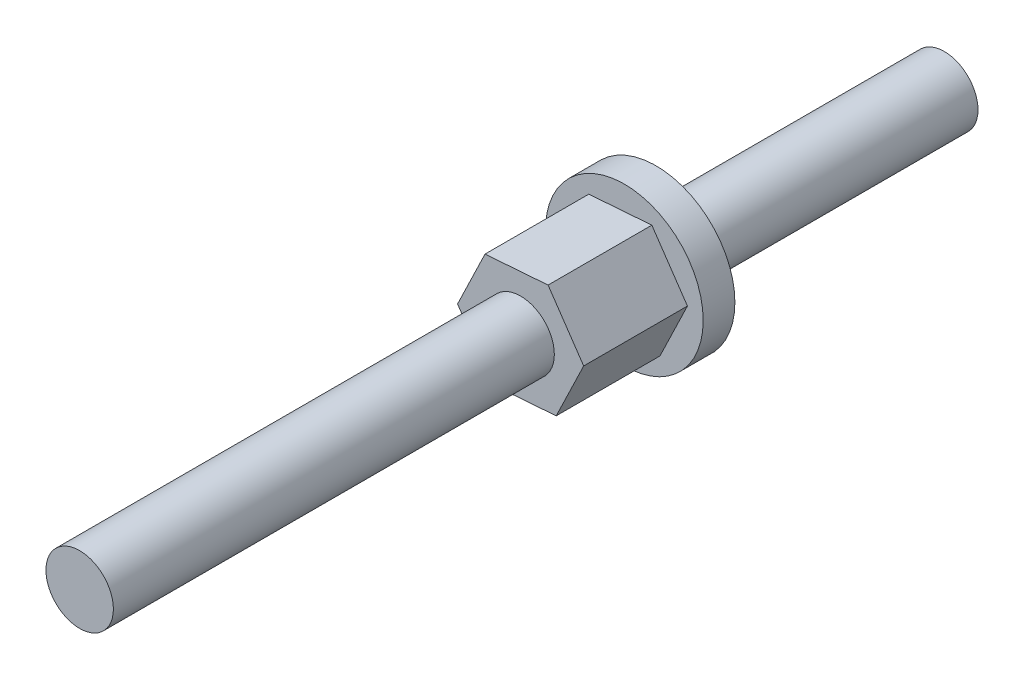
ISO-10303-21;
HEADER;
FILE_DESCRIPTION(('STEP AP214'),'2;1');
FILE_NAME('part.step','',(''),(''),'','','');
FILE_SCHEMA(('AUTOMOTIVE_DESIGN { 1 0 10303 214 1 1 1 1 }'));
ENDSEC;
DATA;
#1=APPLICATION_CONTEXT('core data for automotive mechanical design processes');
#2=APPLICATION_PROTOCOL_DEFINITION('international standard','automotive_design',2000,#1);
#3=PRODUCT_CONTEXT('',#1,'mechanical');
#4=PRODUCT('Part','Part','',(#3));
#5=PRODUCT_RELATED_PRODUCT_CATEGORY('part','',(#4));
#6=PRODUCT_DEFINITION_FORMATION('','',#4);
#7=PRODUCT_DEFINITION_CONTEXT('part definition',#1,'design');
#8=PRODUCT_DEFINITION('design','',#6,#7);
#9=PRODUCT_DEFINITION_SHAPE('','',#8);
#10=(LENGTH_UNIT() NAMED_UNIT(*) SI_UNIT(.MILLI.,.METRE.));
#11=(NAMED_UNIT(*) PLANE_ANGLE_UNIT() SI_UNIT($,.RADIAN.));
#12=(NAMED_UNIT(*) SI_UNIT($,.STERADIAN.) SOLID_ANGLE_UNIT());
#13=UNCERTAINTY_MEASURE_WITH_UNIT(LENGTH_MEASURE(1.E-05),#10,'distance_accuracy_value','');
#14=(GEOMETRIC_REPRESENTATION_CONTEXT(3) GLOBAL_UNCERTAINTY_ASSIGNED_CONTEXT((#13)) GLOBAL_UNIT_ASSIGNED_CONTEXT((#10,
#11,#12)) REPRESENTATION_CONTEXT('',''));
#15=CARTESIAN_POINT('',(0.,0.,0.));
#16=DIRECTION('',(0.,0.,1.));
#17=DIRECTION('',(1.,0.,0.));
#18=AXIS2_PLACEMENT_3D('',#15,#16,#17);
#19=CARTESIAN_POINT('',(70.1748640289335,0.,2.794));
#20=DIRECTION('',(0.,0.,1.));
#21=DIRECTION('',(1.,0.,0.));
#22=AXIS2_PLACEMENT_3D('',#19,#20,#21);
#23=PLANE('',#22);
#24=CARTESIAN_POINT('',(70.1748640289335,0.,2.794));
#25=DIRECTION('',(0.,0.,1.));
#26=DIRECTION('',(1.,0.,0.));
#27=AXIS2_PLACEMENT_3D('',#24,#25,#26);
#28=CIRCLE('',#27,6.94690000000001);
#29=CARTESIAN_POINT('',(77.1217640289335,0.,2.794));
#30=VERTEX_POINT('',#29);
#31=EDGE_CURVE('E127',#30,#30,#28,.T.);
#32=ORIENTED_EDGE('',*,*,#31,.T.);
#33=EDGE_LOOP('',(#32));
#34=FACE_BOUND('',#33,.T.);
#35=DIRECTION('',(-0.434295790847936,-0.9007703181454,0.));
#36=VECTOR('',#35,1.);
#37=CARTESIAN_POINT('',(74.5219815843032,-2.09591148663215,2.794));
#38=LINE('',#37,#36);
#39=CARTESIAN_POINT('',(75.7320566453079,0.413898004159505,2.794));
#40=VERTEX_POINT('',#39);
#41=CARTESIAN_POINT('',(73.3119065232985,-4.6057209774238,2.794));
#42=VERTEX_POINT('',#41);
#43=EDGE_CURVE('E123',#40,#42,#38,.T.);
#44=ORIENTED_EDGE('',*,*,#43,.T.);
#45=DIRECTION('',(-0.997237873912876,-0.0742739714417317,0.));
#46=VECTOR('',#45,1.);
#47=CARTESIAN_POINT('',(70.5333102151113,-4.81266997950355,2.794));
#48=LINE('',#47,#46);
#49=CARTESIAN_POINT('',(67.7547139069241,-5.0196189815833,2.794));
#50=VERTEX_POINT('',#49);
#51=EDGE_CURVE('E56',#42,#50,#48,.T.);
#52=ORIENTED_EDGE('',*,*,#51,.T.);
#53=DIRECTION('',(-0.562942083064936,0.826496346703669,0.));
#54=VECTOR('',#53,1.);
#55=CARTESIAN_POINT('',(66.1861926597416,-2.71675849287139,2.794));
#56=LINE('',#55,#54);
#57=CARTESIAN_POINT('',(64.6176714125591,-0.413898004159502,2.794));
#58=VERTEX_POINT('',#57);
#59=EDGE_CURVE('E106',#50,#58,#56,.T.);
#60=ORIENTED_EDGE('',*,*,#59,.T.);
#61=DIRECTION('',(0.434295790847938,0.9007703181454,0.));
#62=VECTOR('',#61,1.);
#63=CARTESIAN_POINT('',(65.8277464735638,2.09591148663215,2.794));
#64=LINE('',#63,#62);
#65=CARTESIAN_POINT('',(67.0378215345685,4.60572097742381,2.794));
#66=VERTEX_POINT('',#65);
#67=EDGE_CURVE('E109',#58,#66,#64,.T.);
#68=ORIENTED_EDGE('',*,*,#67,.T.);
#69=DIRECTION('',(0.997237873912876,0.0742739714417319,0.));
#70=VECTOR('',#69,1.);
#71=CARTESIAN_POINT('',(69.8164178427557,4.81266997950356,2.794));
#72=LINE('',#71,#70);
#73=CARTESIAN_POINT('',(72.595014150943,5.01961898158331,2.794));
#74=VERTEX_POINT('',#73);
#75=EDGE_CURVE('E117',#66,#74,#72,.T.);
#76=ORIENTED_EDGE('',*,*,#75,.T.);
#77=DIRECTION('',(0.562942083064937,-0.826496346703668,0.));
#78=VECTOR('',#77,1.);
#79=CARTESIAN_POINT('',(74.1635353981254,2.7167584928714,2.794));
#80=LINE('',#79,#78);
#81=EDGE_CURVE('E120',#74,#40,#80,.T.);
#82=ORIENTED_EDGE('',*,*,#81,.T.);
#83=EDGE_LOOP('',(#44,#52,#60,#68,#76,#82));
#84=FACE_BOUND('',#83,.T.);
#85=ADVANCED_FACE('F33',(#34,#84),#23,.T.);
#86=CARTESIAN_POINT('',(70.1748640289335,0.,2.794));
#87=DIRECTION('',(0.,0.,-1.));
#88=DIRECTION('',(-1.,0.,0.));
#89=AXIS2_PLACEMENT_3D('',#86,#87,#88);
#90=CYLINDRICAL_SURFACE('',#89,6.94690000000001);
#91=ORIENTED_EDGE('',*,*,#31,.F.);
#92=EDGE_LOOP('',(#91));
#93=FACE_BOUND('',#92,.T.);
#94=CARTESIAN_POINT('',(70.1748640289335,0.,0.));
#95=DIRECTION('',(0.,0.,1.));
#96=DIRECTION('',(1.,0.,0.));
#97=AXIS2_PLACEMENT_3D('',#94,#95,#96);
#98=CIRCLE('',#97,6.94690000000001);
#99=CARTESIAN_POINT('',(77.1217640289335,0.,0.));
#100=VERTEX_POINT('',#99);
#101=EDGE_CURVE('E126',#100,#100,#98,.T.);
#102=ORIENTED_EDGE('',*,*,#101,.T.);
#103=EDGE_LOOP('',(#102));
#104=FACE_BOUND('',#103,.T.);
#105=ADVANCED_FACE('F146',(#93,#104),#90,.T.);
#106=CARTESIAN_POINT('',(70.1748640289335,0.,0.));
#107=DIRECTION('',(0.,0.,1.));
#108=DIRECTION('',(1.,0.,0.));
#109=AXIS2_PLACEMENT_3D('',#106,#107,#108);
#110=PLANE('',#109);
#111=CARTESIAN_POINT('',(70.1748640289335,0.,0.));
#112=DIRECTION('',(0.,0.,1.));
#113=DIRECTION('',(1.,0.,0.));
#114=AXIS2_PLACEMENT_3D('',#111,#112,#113);
#115=CIRCLE('',#114,2.9718);
#116=CARTESIAN_POINT('',(73.1466640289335,0.,0.));
#117=VERTEX_POINT('',#116);
#118=EDGE_CURVE('E130',#117,#117,#115,.F.);
#119=ORIENTED_EDGE('',*,*,#118,.F.);
#120=EDGE_LOOP('',(#119));
#121=FACE_BOUND('',#120,.T.);
#122=ORIENTED_EDGE('',*,*,#101,.F.);
#123=EDGE_LOOP('',(#122));
#124=FACE_BOUND('',#123,.T.);
#125=ADVANCED_FACE('F142',(#121,#124),#110,.F.);
#126=CARTESIAN_POINT('',(70.1748640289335,0.,-25.4));
#127=DIRECTION('',(0.,0.,1.));
#128=DIRECTION('',(1.,0.,0.));
#129=AXIS2_PLACEMENT_3D('',#126,#127,#128);
#130=PLANE('',#129);
#131=CARTESIAN_POINT('',(70.1748640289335,0.,-25.4));
#132=DIRECTION('',(0.,0.,1.));
#133=DIRECTION('',(1.,0.,0.));
#134=AXIS2_PLACEMENT_3D('',#131,#132,#133);
#135=CIRCLE('',#134,2.9718);
#136=CARTESIAN_POINT('',(73.1466640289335,0.,-25.4));
#137=VERTEX_POINT('',#136);
#138=EDGE_CURVE('E41',#137,#137,#135,.T.);
#139=ORIENTED_EDGE('',*,*,#138,.F.);
#140=EDGE_LOOP('',(#139));
#141=FACE_BOUND('',#140,.T.);
#142=ADVANCED_FACE('F145',(#141),#130,.F.);
#143=CARTESIAN_POINT('',(70.1748640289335,0.,-25.4));
#144=DIRECTION('',(0.,0.,1.));
#145=DIRECTION('',(1.,0.,0.));
#146=AXIS2_PLACEMENT_3D('',#143,#144,#145);
#147=CYLINDRICAL_SURFACE('',#146,2.9718);
#148=ORIENTED_EDGE('',*,*,#138,.T.);
#149=EDGE_LOOP('',(#148));
#150=FACE_BOUND('',#149,.T.);
#151=ORIENTED_EDGE('',*,*,#118,.T.);
#152=EDGE_LOOP('',(#151));
#153=FACE_BOUND('',#152,.T.);
#154=ADVANCED_FACE('F140',(#150,#153),#147,.T.);
#155=CARTESIAN_POINT('',(67.7547139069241,-5.0196189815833,11.938));
#156=DIRECTION('',(-0.0742739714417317,0.997237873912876,0.));
#157=DIRECTION('',(-0.997237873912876,-0.0742739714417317,0.));
#158=AXIS2_PLACEMENT_3D('',#155,#156,#157);
#159=PLANE('',#158);
#160=ORIENTED_EDGE('',*,*,#51,.F.);
#161=DIRECTION('',(0.,0.,-1.));
#162=VECTOR('',#161,1.);
#163=CARTESIAN_POINT('',(73.3119065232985,-4.6057209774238,11.938));
#164=LINE('',#163,#162);
#165=CARTESIAN_POINT('',(73.3119065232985,-4.6057209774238,11.938));
#166=VERTEX_POINT('',#165);
#167=EDGE_CURVE('E91',#166,#42,#164,.T.);
#168=ORIENTED_EDGE('',*,*,#167,.F.);
#169=DIRECTION('',(0.997237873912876,0.0742739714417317,0.));
#170=VECTOR('',#169,1.);
#171=CARTESIAN_POINT('',(67.7547139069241,-5.0196189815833,11.938));
#172=LINE('',#171,#170);
#173=CARTESIAN_POINT('',(67.7547139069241,-5.0196189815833,11.938));
#174=VERTEX_POINT('',#173);
#175=EDGE_CURVE('E98',#174,#166,#172,.T.);
#176=ORIENTED_EDGE('',*,*,#175,.F.);
#177=DIRECTION('',(0.,0.,-1.));
#178=VECTOR('',#177,1.);
#179=CARTESIAN_POINT('',(67.7547139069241,-5.0196189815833,11.938));
#180=LINE('',#179,#178);
#181=EDGE_CURVE('E288',#174,#50,#180,.T.);
#182=ORIENTED_EDGE('',*,*,#181,.T.);
#183=EDGE_LOOP('',(#160,#168,#176,#182));
#184=FACE_BOUND('',#183,.T.);
#185=ADVANCED_FACE('F105',(#184),#159,.F.);
#186=CARTESIAN_POINT('',(73.3119065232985,-4.6057209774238,11.938));
#187=DIRECTION('',(-0.9007703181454,0.434295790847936,0.));
#188=DIRECTION('',(-0.434295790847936,-0.9007703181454,0.));
#189=AXIS2_PLACEMENT_3D('',#186,#187,#188);
#190=PLANE('',#189);
#191=ORIENTED_EDGE('',*,*,#43,.F.);
#192=DIRECTION('',(0.,0.,-1.));
#193=VECTOR('',#192,1.);
#194=CARTESIAN_POINT('',(75.7320566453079,0.413898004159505,11.938));
#195=LINE('',#194,#193);
#196=CARTESIAN_POINT('',(75.7320566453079,0.413898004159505,11.938));
#197=VERTEX_POINT('',#196);
#198=EDGE_CURVE('E94',#197,#40,#195,.T.);
#199=ORIENTED_EDGE('',*,*,#198,.F.);
#200=DIRECTION('',(0.434295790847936,0.9007703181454,0.));
#201=VECTOR('',#200,1.);
#202=CARTESIAN_POINT('',(73.3119065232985,-4.6057209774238,11.938));
#203=LINE('',#202,#201);
#204=EDGE_CURVE('E88',#166,#197,#203,.T.);
#205=ORIENTED_EDGE('',*,*,#204,.F.);
#206=ORIENTED_EDGE('',*,*,#167,.T.);
#207=EDGE_LOOP('',(#191,#199,#205,#206));
#208=FACE_BOUND('',#207,.T.);
#209=ADVANCED_FACE('F90',(#208),#190,.F.);
#210=CARTESIAN_POINT('',(75.7320566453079,0.413898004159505,11.938));
#211=DIRECTION('',(-0.826496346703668,-0.562942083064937,0.));
#212=DIRECTION('',(0.562942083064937,-0.826496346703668,0.));
#213=AXIS2_PLACEMENT_3D('',#210,#211,#212);
#214=PLANE('',#213);
#215=ORIENTED_EDGE('',*,*,#81,.F.);
#216=DIRECTION('',(0.,0.,-1.));
#217=VECTOR('',#216,1.);
#218=CARTESIAN_POINT('',(72.595014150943,5.01961898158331,11.938));
#219=LINE('',#218,#217);
#220=CARTESIAN_POINT('',(72.595014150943,5.01961898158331,11.938));
#221=VERTEX_POINT('',#220);
#222=EDGE_CURVE('E111',#221,#74,#219,.T.);
#223=ORIENTED_EDGE('',*,*,#222,.F.);
#224=DIRECTION('',(-0.562942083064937,0.826496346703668,0.));
#225=VECTOR('',#224,1.);
#226=CARTESIAN_POINT('',(75.7320566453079,0.413898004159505,11.938));
#227=LINE('',#226,#225);
#228=EDGE_CURVE('E97',#197,#221,#227,.T.);
#229=ORIENTED_EDGE('',*,*,#228,.F.);
#230=ORIENTED_EDGE('',*,*,#198,.T.);
#231=EDGE_LOOP('',(#215,#223,#229,#230));
#232=FACE_BOUND('',#231,.T.);
#233=ADVANCED_FACE('F197',(#232),#214,.F.);
#234=CARTESIAN_POINT('',(72.595014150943,5.01961898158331,11.938));
#235=DIRECTION('',(0.0742739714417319,-0.997237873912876,0.));
#236=DIRECTION('',(0.997237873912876,0.0742739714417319,0.));
#237=AXIS2_PLACEMENT_3D('',#234,#235,#236);
#238=PLANE('',#237);
#239=ORIENTED_EDGE('',*,*,#75,.F.);
#240=DIRECTION('',(0.,0.,-1.));
#241=VECTOR('',#240,1.);
#242=CARTESIAN_POINT('',(67.0378215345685,4.60572097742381,11.938));
#243=LINE('',#242,#241);
#244=CARTESIAN_POINT('',(67.0378215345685,4.60572097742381,11.938));
#245=VERTEX_POINT('',#244);
#246=EDGE_CURVE('E284',#245,#66,#243,.T.);
#247=ORIENTED_EDGE('',*,*,#246,.F.);
#248=DIRECTION('',(-0.997237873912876,-0.0742739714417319,0.));
#249=VECTOR('',#248,1.);
#250=CARTESIAN_POINT('',(72.595014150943,5.01961898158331,11.938));
#251=LINE('',#250,#249);
#252=EDGE_CURVE('E283',#221,#245,#251,.T.);
#253=ORIENTED_EDGE('',*,*,#252,.F.);
#254=ORIENTED_EDGE('',*,*,#222,.T.);
#255=EDGE_LOOP('',(#239,#247,#253,#254));
#256=FACE_BOUND('',#255,.T.);
#257=ADVANCED_FACE('F193',(#256),#238,.F.);
#258=CARTESIAN_POINT('',(67.0378215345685,4.60572097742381,11.938));
#259=DIRECTION('',(0.9007703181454,-0.434295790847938,0.));
#260=DIRECTION('',(0.434295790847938,0.9007703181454,0.));
#261=AXIS2_PLACEMENT_3D('',#258,#259,#260);
#262=PLANE('',#261);
#263=ORIENTED_EDGE('',*,*,#67,.F.);
#264=DIRECTION('',(0.,0.,-1.));
#265=VECTOR('',#264,1.);
#266=CARTESIAN_POINT('',(64.6176714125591,-0.413898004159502,11.938));
#267=LINE('',#266,#265);
#268=CARTESIAN_POINT('',(64.6176714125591,-0.413898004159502,11.938));
#269=VERTEX_POINT('',#268);
#270=EDGE_CURVE('E48',#269,#58,#267,.T.);
#271=ORIENTED_EDGE('',*,*,#270,.F.);
#272=DIRECTION('',(-0.434295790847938,-0.900770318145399,0.));
#273=VECTOR('',#272,1.);
#274=CARTESIAN_POINT('',(67.0378215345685,4.60572097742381,11.938));
#275=LINE('',#274,#273);
#276=EDGE_CURVE('E286',#245,#269,#275,.T.);
#277=ORIENTED_EDGE('',*,*,#276,.F.);
#278=ORIENTED_EDGE('',*,*,#246,.T.);
#279=EDGE_LOOP('',(#263,#271,#277,#278));
#280=FACE_BOUND('',#279,.T.);
#281=ADVANCED_FACE('F188',(#280),#262,.F.);
#282=CARTESIAN_POINT('',(64.6176714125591,-0.413898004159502,11.938));
#283=DIRECTION('',(0.826496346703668,0.562942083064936,0.));
#284=DIRECTION('',(-0.562942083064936,0.826496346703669,0.));
#285=AXIS2_PLACEMENT_3D('',#282,#283,#284);
#286=PLANE('',#285);
#287=ORIENTED_EDGE('',*,*,#59,.F.);
#288=ORIENTED_EDGE('',*,*,#181,.F.);
#289=DIRECTION('',(0.562942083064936,-0.826496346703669,0.));
#290=VECTOR('',#289,1.);
#291=CARTESIAN_POINT('',(64.6176714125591,-0.413898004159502,11.938));
#292=LINE('',#291,#290);
#293=EDGE_CURVE('E102',#269,#174,#292,.T.);
#294=ORIENTED_EDGE('',*,*,#293,.F.);
#295=ORIENTED_EDGE('',*,*,#270,.T.);
#296=EDGE_LOOP('',(#287,#288,#294,#295));
#297=FACE_BOUND('',#296,.T.);
#298=ADVANCED_FACE('F183',(#297),#286,.F.);
#299=CARTESIAN_POINT('',(0.,0.,11.938));
#300=DIRECTION('',(0.,0.,1.));
#301=DIRECTION('',(1.,0.,0.));
#302=AXIS2_PLACEMENT_3D('',#299,#300,#301);
#303=PLANE('',#302);
#304=CARTESIAN_POINT('',(70.1748640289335,0.,11.938));
#305=DIRECTION('',(0.,0.,1.));
#306=DIRECTION('',(1.,0.,0.));
#307=AXIS2_PLACEMENT_3D('',#304,#305,#306);
#308=CIRCLE('',#307,2.9718);
#309=CARTESIAN_POINT('',(73.1466640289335,0.,11.938));
#310=VERTEX_POINT('',#309);
#311=EDGE_CURVE('E11',#310,#310,#308,.F.);
#312=ORIENTED_EDGE('',*,*,#311,.T.);
#313=EDGE_LOOP('',(#312));
#314=FACE_BOUND('',#313,.T.);
#315=ORIENTED_EDGE('',*,*,#175,.T.);
#316=ORIENTED_EDGE('',*,*,#204,.T.);
#317=ORIENTED_EDGE('',*,*,#228,.T.);
#318=ORIENTED_EDGE('',*,*,#252,.T.);
#319=ORIENTED_EDGE('',*,*,#276,.T.);
#320=ORIENTED_EDGE('',*,*,#293,.T.);
#321=EDGE_LOOP('',(#315,#316,#317,#318,#319,#320));
#322=FACE_BOUND('',#321,.T.);
#323=ADVANCED_FACE('F101',(#314,#322),#303,.T.);
#324=CARTESIAN_POINT('',(70.1748640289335,0.,50.8));
#325=DIRECTION('',(0.,0.,1.));
#326=DIRECTION('',(1.,0.,0.));
#327=AXIS2_PLACEMENT_3D('',#324,#325,#326);
#328=PLANE('',#327);
#329=CARTESIAN_POINT('',(70.1748640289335,0.,50.8));
#330=DIRECTION('',(0.,0.,1.));
#331=DIRECTION('',(1.,0.,0.));
#332=AXIS2_PLACEMENT_3D('',#329,#330,#331);
#333=CIRCLE('',#332,2.9718);
#334=CARTESIAN_POINT('',(73.1466640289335,0.,50.8));
#335=VERTEX_POINT('',#334);
#336=EDGE_CURVE('E133',#335,#335,#333,.T.);
#337=ORIENTED_EDGE('',*,*,#336,.T.);
#338=EDGE_LOOP('',(#337));
#339=FACE_BOUND('',#338,.T.);
#340=ADVANCED_FACE('F160',(#339),#328,.T.);
#341=ORIENTED_EDGE('',*,*,#311,.F.);
#342=EDGE_LOOP('',(#341));
#343=FACE_BOUND('',#342,.T.);
#344=ORIENTED_EDGE('',*,*,#336,.F.);
#345=EDGE_LOOP('',(#344));
#346=FACE_BOUND('',#345,.T.);
#347=ADVANCED_FACE('F35',(#343,#346),#147,.T.);
#348=CLOSED_SHELL('',(#85,#105,#125,#142,#154,#185,#209,#233,#257,#281,#298,#323,#340,#347));
#349=MANIFOLD_SOLID_BREP('B2',#348);
#350=ADVANCED_BREP_SHAPE_REPRESENTATION('',(#18,#349),#14);
#351=SHAPE_DEFINITION_REPRESENTATION(#9,#350);
ENDSEC;
END-ISO-10303-21;
